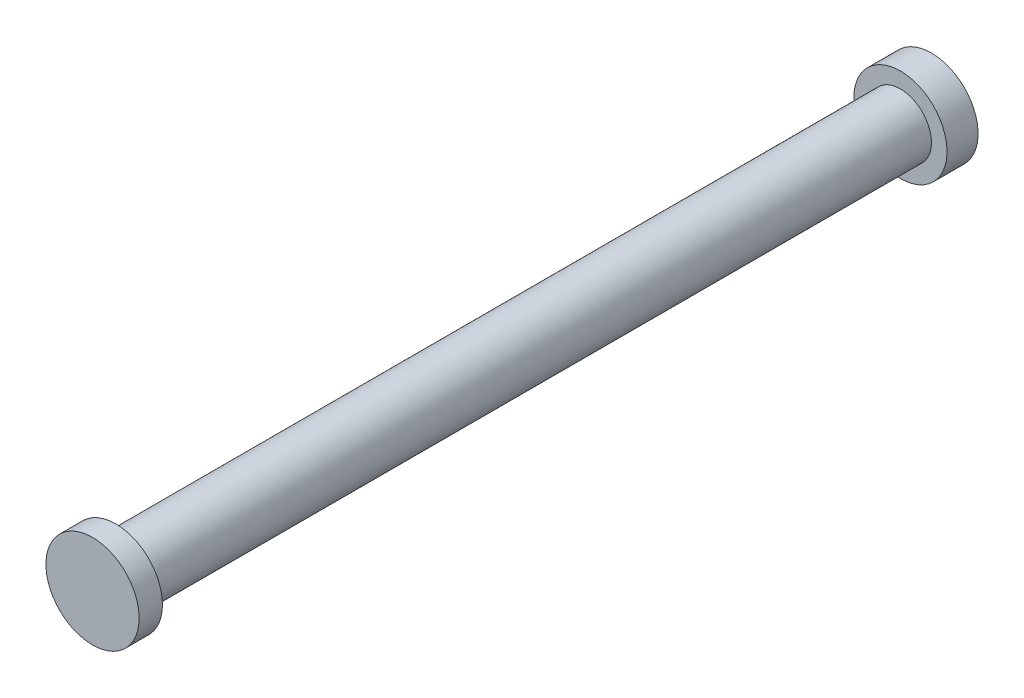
ISO-10303-21;
HEADER;
FILE_DESCRIPTION(('STEP AP214'),'2;1');
FILE_NAME('part.step','',(''),(''),'','','');
FILE_SCHEMA(('AUTOMOTIVE_DESIGN { 1 0 10303 214 1 1 1 1 }'));
ENDSEC;
DATA;
#1=APPLICATION_CONTEXT('core data for automotive mechanical design processes');
#2=APPLICATION_PROTOCOL_DEFINITION('international standard','automotive_design',2000,#1);
#3=PRODUCT_CONTEXT('',#1,'mechanical');
#4=PRODUCT('Part','Part','',(#3));
#5=PRODUCT_RELATED_PRODUCT_CATEGORY('part','',(#4));
#6=PRODUCT_DEFINITION_FORMATION('','',#4);
#7=PRODUCT_DEFINITION_CONTEXT('part definition',#1,'design');
#8=PRODUCT_DEFINITION('design','',#6,#7);
#9=PRODUCT_DEFINITION_SHAPE('','',#8);
#10=(LENGTH_UNIT() NAMED_UNIT(*) SI_UNIT(.MILLI.,.METRE.));
#11=(NAMED_UNIT(*) PLANE_ANGLE_UNIT() SI_UNIT($,.RADIAN.));
#12=(NAMED_UNIT(*) SI_UNIT($,.STERADIAN.) SOLID_ANGLE_UNIT());
#13=UNCERTAINTY_MEASURE_WITH_UNIT(LENGTH_MEASURE(1.E-05),#10,'distance_accuracy_value','');
#14=(GEOMETRIC_REPRESENTATION_CONTEXT(3) GLOBAL_UNCERTAINTY_ASSIGNED_CONTEXT((#13)) GLOBAL_UNIT_ASSIGNED_CONTEXT((#10,
#11,#12)) REPRESENTATION_CONTEXT('',''));
#15=CARTESIAN_POINT('',(0.,0.,0.));
#16=DIRECTION('',(0.,0.,1.));
#17=DIRECTION('',(1.,0.,0.));
#18=AXIS2_PLACEMENT_3D('',#15,#16,#17);
#19=CARTESIAN_POINT('',(0.,0.,3.));
#20=DIRECTION('',(0.,0.,-1.));
#21=DIRECTION('',(-1.,0.,0.));
#22=AXIS2_PLACEMENT_3D('',#19,#20,#21);
#23=CYLINDRICAL_SURFACE('',#22,6.);
#24=CARTESIAN_POINT('',(0.,0.,3.));
#25=DIRECTION('',(0.,0.,1.));
#26=DIRECTION('',(1.,0.,0.));
#27=AXIS2_PLACEMENT_3D('',#24,#25,#26);
#28=CIRCLE('',#27,6.);
#29=CARTESIAN_POINT('',(6.,0.,3.));
#30=VERTEX_POINT('',#29);
#31=EDGE_CURVE('E45',#30,#30,#28,.T.);
#32=ORIENTED_EDGE('',*,*,#31,.F.);
#33=EDGE_LOOP('',(#32));
#34=FACE_BOUND('',#33,.T.);
#35=CARTESIAN_POINT('',(0.,0.,0.));
#36=DIRECTION('',(0.,0.,1.));
#37=DIRECTION('',(1.,0.,0.));
#38=AXIS2_PLACEMENT_3D('',#35,#36,#37);
#39=CIRCLE('',#38,6.);
#40=CARTESIAN_POINT('',(6.,0.,0.));
#41=VERTEX_POINT('',#40);
#42=EDGE_CURVE('E40',#41,#41,#39,.T.);
#43=ORIENTED_EDGE('',*,*,#42,.T.);
#44=EDGE_LOOP('',(#43));
#45=FACE_BOUND('',#44,.T.);
#46=ADVANCED_FACE('F37',(#34,#45),#23,.T.);
#47=CARTESIAN_POINT('',(0.,0.,3.));
#48=DIRECTION('',(0.,0.,1.));
#49=DIRECTION('',(1.,0.,0.));
#50=AXIS2_PLACEMENT_3D('',#47,#48,#49);
#51=PLANE('',#50);
#52=ORIENTED_EDGE('',*,*,#31,.T.);
#53=EDGE_LOOP('',(#52));
#54=FACE_BOUND('',#53,.T.);
#55=ADVANCED_FACE('F83',(#54),#51,.T.);
#56=CARTESIAN_POINT('',(0.,0.,0.));
#57=DIRECTION('',(0.,0.,1.));
#58=DIRECTION('',(1.,0.,0.));
#59=AXIS2_PLACEMENT_3D('',#56,#57,#58);
#60=PLANE('',#59);
#61=CARTESIAN_POINT('',(0.,0.,0.));
#62=DIRECTION('',(0.,0.,-1.));
#63=DIRECTION('',(-1.,0.,0.));
#64=AXIS2_PLACEMENT_3D('',#61,#62,#63);
#65=CIRCLE('',#64,4.);
#66=CARTESIAN_POINT('',(-4.,0.,0.));
#67=VERTEX_POINT('',#66);
#68=EDGE_CURVE('E10',#67,#67,#65,.T.);
#69=ORIENTED_EDGE('',*,*,#68,.F.);
#70=EDGE_LOOP('',(#69));
#71=FACE_BOUND('',#70,.T.);
#72=ORIENTED_EDGE('',*,*,#42,.F.);
#73=EDGE_LOOP('',(#72));
#74=FACE_BOUND('',#73,.T.);
#75=ADVANCED_FACE('F88',(#71,#74),#60,.F.);
#76=CARTESIAN_POINT('',(0.,0.,-101.));
#77=DIRECTION('',(0.,0.,1.));
#78=DIRECTION('',(1.,0.,0.));
#79=AXIS2_PLACEMENT_3D('',#76,#77,#78);
#80=CYLINDRICAL_SURFACE('',#79,4.);
#81=CARTESIAN_POINT('',(0.,0.,-101.));
#82=DIRECTION('',(0.,0.,-1.));
#83=DIRECTION('',(-1.,0.,0.));
#84=AXIS2_PLACEMENT_3D('',#81,#82,#83);
#85=CIRCLE('',#84,4.);
#86=CARTESIAN_POINT('',(-4.,0.,-101.));
#87=VERTEX_POINT('',#86);
#88=EDGE_CURVE('E52',#87,#87,#85,.T.);
#89=ORIENTED_EDGE('',*,*,#88,.F.);
#90=EDGE_LOOP('',(#89));
#91=FACE_BOUND('',#90,.T.);
#92=ORIENTED_EDGE('',*,*,#68,.T.);
#93=EDGE_LOOP('',(#92));
#94=FACE_BOUND('',#93,.T.);
#95=ADVANCED_FACE('F70',(#91,#94),#80,.T.);
#96=CARTESIAN_POINT('',(0.,0.,-105.));
#97=DIRECTION('',(0.,0.,1.));
#98=DIRECTION('',(1.,0.,0.));
#99=AXIS2_PLACEMENT_3D('',#96,#97,#98);
#100=CYLINDRICAL_SURFACE('',#99,6.);
#101=CARTESIAN_POINT('',(0.,0.,-105.));
#102=DIRECTION('',(0.,0.,-1.));
#103=DIRECTION('',(-1.,0.,0.));
#104=AXIS2_PLACEMENT_3D('',#101,#102,#103);
#105=CIRCLE('',#104,6.);
#106=CARTESIAN_POINT('',(-6.,0.,-105.));
#107=VERTEX_POINT('',#106);
#108=EDGE_CURVE('E56',#107,#107,#105,.T.);
#109=ORIENTED_EDGE('',*,*,#108,.F.);
#110=EDGE_LOOP('',(#109));
#111=FACE_BOUND('',#110,.T.);
#112=CARTESIAN_POINT('',(0.,0.,-101.));
#113=DIRECTION('',(0.,0.,-1.));
#114=DIRECTION('',(-1.,0.,0.));
#115=AXIS2_PLACEMENT_3D('',#112,#113,#114);
#116=CIRCLE('',#115,6.);
#117=CARTESIAN_POINT('',(-6.,0.,-101.));
#118=VERTEX_POINT('',#117);
#119=EDGE_CURVE('E57',#118,#118,#116,.T.);
#120=ORIENTED_EDGE('',*,*,#119,.T.);
#121=EDGE_LOOP('',(#120));
#122=FACE_BOUND('',#121,.T.);
#123=ADVANCED_FACE('F67',(#111,#122),#100,.T.);
#124=CARTESIAN_POINT('',(0.,0.,-105.));
#125=DIRECTION('',(0.,0.,-1.));
#126=DIRECTION('',(-1.,0.,0.));
#127=AXIS2_PLACEMENT_3D('',#124,#125,#126);
#128=PLANE('',#127);
#129=ORIENTED_EDGE('',*,*,#108,.T.);
#130=EDGE_LOOP('',(#129));
#131=FACE_BOUND('',#130,.T.);
#132=ADVANCED_FACE('F65',(#131),#128,.T.);
#133=CARTESIAN_POINT('',(0.,0.,-101.));
#134=DIRECTION('',(0.,0.,-1.));
#135=DIRECTION('',(-1.,0.,0.));
#136=AXIS2_PLACEMENT_3D('',#133,#134,#135);
#137=PLANE('',#136);
#138=ORIENTED_EDGE('',*,*,#88,.T.);
#139=EDGE_LOOP('',(#138));
#140=FACE_BOUND('',#139,.T.);
#141=ORIENTED_EDGE('',*,*,#119,.F.);
#142=EDGE_LOOP('',(#141));
#143=FACE_BOUND('',#142,.T.);
#144=ADVANCED_FACE('F74',(#140,#143),#137,.F.);
#145=CLOSED_SHELL('',(#46,#55,#75,#95,#123,#132,#144));
#146=MANIFOLD_SOLID_BREP('B2',#145);
#147=ADVANCED_BREP_SHAPE_REPRESENTATION('',(#18,#146),#14);
#148=SHAPE_DEFINITION_REPRESENTATION(#9,#147);
ENDSEC;
END-ISO-10303-21;
